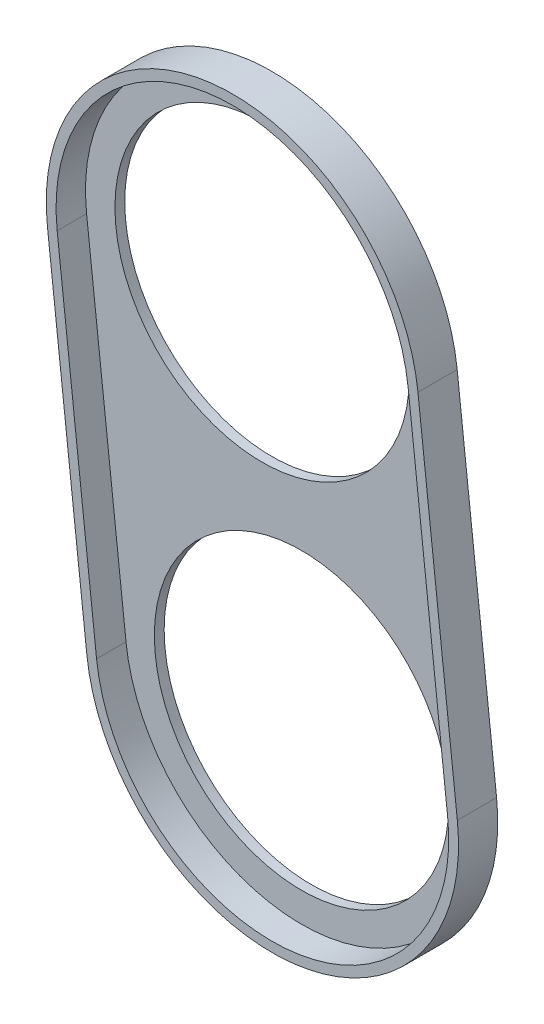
ISO-10303-21;
HEADER;
FILE_DESCRIPTION(('STEP AP214'),'2;1');
FILE_NAME('part.step','',(''),(''),'','','');
FILE_SCHEMA(('AUTOMOTIVE_DESIGN { 1 0 10303 214 1 1 1 1 }'));
ENDSEC;
DATA;
#1=APPLICATION_CONTEXT('core data for automotive mechanical design processes');
#2=APPLICATION_PROTOCOL_DEFINITION('international standard','automotive_design',2000,#1);
#3=PRODUCT_CONTEXT('',#1,'mechanical');
#4=PRODUCT('Part','Part','',(#3));
#5=PRODUCT_RELATED_PRODUCT_CATEGORY('part','',(#4));
#6=PRODUCT_DEFINITION_FORMATION('','',#4);
#7=PRODUCT_DEFINITION_CONTEXT('part definition',#1,'design');
#8=PRODUCT_DEFINITION('design','',#6,#7);
#9=PRODUCT_DEFINITION_SHAPE('','',#8);
#10=(LENGTH_UNIT() NAMED_UNIT(*) SI_UNIT(.MILLI.,.METRE.));
#11=(NAMED_UNIT(*) PLANE_ANGLE_UNIT() SI_UNIT($,.RADIAN.));
#12=(NAMED_UNIT(*) SI_UNIT($,.STERADIAN.) SOLID_ANGLE_UNIT());
#13=UNCERTAINTY_MEASURE_WITH_UNIT(LENGTH_MEASURE(1.E-05),#10,'distance_accuracy_value','');
#14=(GEOMETRIC_REPRESENTATION_CONTEXT(3) GLOBAL_UNCERTAINTY_ASSIGNED_CONTEXT((#13)) GLOBAL_UNIT_ASSIGNED_CONTEXT((#10,
#11,#12)) REPRESENTATION_CONTEXT('',''));
#15=CARTESIAN_POINT('',(0.,0.,0.));
#16=DIRECTION('',(0.,0.,1.));
#17=DIRECTION('',(1.,0.,0.));
#18=AXIS2_PLACEMENT_3D('',#15,#16,#17);
#19=CARTESIAN_POINT('',(10.0417507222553,-89.4380413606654,10.));
#20=DIRECTION('',(0.,0.,-1.));
#21=DIRECTION('',(-1.,0.,0.));
#22=AXIS2_PLACEMENT_3D('',#19,#20,#21);
#23=CYLINDRICAL_SURFACE('',#22,47.5);
#24=CARTESIAN_POINT('',(10.0417507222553,-89.4380413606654,0.));
#25=DIRECTION('',(0.,0.,1.));
#26=DIRECTION('',(1.,0.,0.));
#27=AXIS2_PLACEMENT_3D('',#24,#25,#26);
#28=CIRCLE('',#27,47.5);
#29=CARTESIAN_POINT('',(-37.1616599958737,-94.7378542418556,0.));
#30=VERTEX_POINT('',#29);
#31=CARTESIAN_POINT('',(57.2451614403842,-84.1382284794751,0.));
#32=VERTEX_POINT('',#31);
#33=EDGE_CURVE('E143',#30,#32,#28,.T.);
#34=ORIENTED_EDGE('',*,*,#33,.T.);
#35=DIRECTION('',(0.,0.,-1.));
#36=VECTOR('',#35,1.);
#37=CARTESIAN_POINT('',(57.2451614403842,-84.1382284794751,10.));
#38=LINE('',#37,#36);
#39=CARTESIAN_POINT('',(57.2451614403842,-84.1382284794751,10.));
#40=VERTEX_POINT('',#39);
#41=EDGE_CURVE('E12',#40,#32,#38,.T.);
#42=ORIENTED_EDGE('',*,*,#41,.F.);
#43=CARTESIAN_POINT('',(10.0417507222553,-89.4380413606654,10.));
#44=DIRECTION('',(0.,0.,1.));
#45=DIRECTION('',(1.,0.,0.));
#46=AXIS2_PLACEMENT_3D('',#43,#44,#45);
#47=CIRCLE('',#46,47.5);
#48=CARTESIAN_POINT('',(-37.1616599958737,-94.7378542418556,10.));
#49=VERTEX_POINT('',#48);
#50=EDGE_CURVE('E145',#49,#40,#47,.T.);
#51=ORIENTED_EDGE('',*,*,#50,.F.);
#52=DIRECTION('',(0.,0.,-1.));
#53=VECTOR('',#52,1.);
#54=CARTESIAN_POINT('',(-37.1616599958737,-94.7378542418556,10.));
#55=LINE('',#54,#53);
#56=EDGE_CURVE('E151',#49,#30,#55,.T.);
#57=ORIENTED_EDGE('',*,*,#56,.T.);
#58=EDGE_LOOP('',(#34,#42,#51,#57));
#59=FACE_BOUND('',#58,.T.);
#60=ADVANCED_FACE('F37',(#59),#23,.T.);
#61=CARTESIAN_POINT('',(47.2034107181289,5.29981288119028,10.));
#62=DIRECTION('',(-0.993756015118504,-0.111575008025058,0.));
#63=DIRECTION('',(0.111575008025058,-0.993756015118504,0.));
#64=AXIS2_PLACEMENT_3D('',#61,#62,#63);
#65=PLANE('',#64);
#66=DIRECTION('',(-0.111575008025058,0.993756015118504,0.));
#67=VECTOR('',#66,1.);
#68=CARTESIAN_POINT('',(47.2034107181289,5.29981288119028,0.));
#69=LINE('',#68,#67);
#70=CARTESIAN_POINT('',(47.2034107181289,5.29981288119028,0.));
#71=VERTEX_POINT('',#70);
#72=EDGE_CURVE('E154',#32,#71,#69,.T.);
#73=ORIENTED_EDGE('',*,*,#72,.T.);
#74=DIRECTION('',(0.,0.,-1.));
#75=VECTOR('',#74,1.);
#76=CARTESIAN_POINT('',(47.2034107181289,5.29981288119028,10.));
#77=LINE('',#76,#75);
#78=CARTESIAN_POINT('',(47.2034107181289,5.29981288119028,10.));
#79=VERTEX_POINT('',#78);
#80=EDGE_CURVE('E44',#79,#71,#77,.T.);
#81=ORIENTED_EDGE('',*,*,#80,.F.);
#82=DIRECTION('',(-0.111575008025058,0.993756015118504,0.));
#83=VECTOR('',#82,1.);
#84=CARTESIAN_POINT('',(47.2034107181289,5.29981288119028,10.));
#85=LINE('',#84,#83);
#86=EDGE_CURVE('E88',#40,#79,#85,.T.);
#87=ORIENTED_EDGE('',*,*,#86,.F.);
#88=ORIENTED_EDGE('',*,*,#41,.T.);
#89=EDGE_LOOP('',(#73,#81,#87,#88));
#90=FACE_BOUND('',#89,.T.);
#91=ADVANCED_FACE('F181',(#90),#65,.F.);
#92=CARTESIAN_POINT('',(0.,0.,10.));
#93=DIRECTION('',(0.,0.,-1.));
#94=DIRECTION('',(-1.,0.,0.));
#95=AXIS2_PLACEMENT_3D('',#92,#93,#94);
#96=CYLINDRICAL_SURFACE('',#95,47.5);
#97=CARTESIAN_POINT('',(0.,0.,0.));
#98=DIRECTION('',(0.,0.,1.));
#99=DIRECTION('',(1.,0.,0.));
#100=AXIS2_PLACEMENT_3D('',#97,#98,#99);
#101=CIRCLE('',#100,47.5);
#102=CARTESIAN_POINT('',(-47.2034107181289,-5.29981288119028,0.));
#103=VERTEX_POINT('',#102);
#104=EDGE_CURVE('E156',#71,#103,#101,.T.);
#105=ORIENTED_EDGE('',*,*,#104,.T.);
#106=DIRECTION('',(0.,0.,-1.));
#107=VECTOR('',#106,1.);
#108=CARTESIAN_POINT('',(-47.2034107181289,-5.29981288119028,10.));
#109=LINE('',#108,#107);
#110=CARTESIAN_POINT('',(-47.2034107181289,-5.29981288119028,10.));
#111=VERTEX_POINT('',#110);
#112=EDGE_CURVE('E160',#111,#103,#109,.T.);
#113=ORIENTED_EDGE('',*,*,#112,.F.);
#114=CARTESIAN_POINT('',(0.,0.,10.));
#115=DIRECTION('',(0.,0.,1.));
#116=DIRECTION('',(1.,0.,0.));
#117=AXIS2_PLACEMENT_3D('',#114,#115,#116);
#118=CIRCLE('',#117,47.5);
#119=EDGE_CURVE('E148',#79,#111,#118,.T.);
#120=ORIENTED_EDGE('',*,*,#119,.F.);
#121=ORIENTED_EDGE('',*,*,#80,.T.);
#122=EDGE_LOOP('',(#105,#113,#120,#121));
#123=FACE_BOUND('',#122,.T.);
#124=ADVANCED_FACE('F165',(#123),#96,.T.);
#125=CARTESIAN_POINT('',(-47.2034107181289,-5.29981288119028,10.));
#126=DIRECTION('',(0.993756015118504,0.111575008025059,0.));
#127=DIRECTION('',(-0.111575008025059,0.993756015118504,0.));
#128=AXIS2_PLACEMENT_3D('',#125,#126,#127);
#129=PLANE('',#128);
#130=DIRECTION('',(0.111575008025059,-0.993756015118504,0.));
#131=VECTOR('',#130,1.);
#132=CARTESIAN_POINT('',(-47.2034107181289,-5.29981288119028,0.));
#133=LINE('',#132,#131);
#134=EDGE_CURVE('E81',#103,#30,#133,.T.);
#135=ORIENTED_EDGE('',*,*,#134,.T.);
#136=ORIENTED_EDGE('',*,*,#56,.F.);
#137=DIRECTION('',(0.111575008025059,-0.993756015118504,0.));
#138=VECTOR('',#137,1.);
#139=CARTESIAN_POINT('',(-47.2034107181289,-5.29981288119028,10.));
#140=LINE('',#139,#138);
#141=EDGE_CURVE('E60',#111,#49,#140,.T.);
#142=ORIENTED_EDGE('',*,*,#141,.F.);
#143=ORIENTED_EDGE('',*,*,#112,.T.);
#144=EDGE_LOOP('',(#135,#136,#142,#143));
#145=FACE_BOUND('',#144,.T.);
#146=ADVANCED_FACE('F173',(#145),#129,.F.);
#147=CARTESIAN_POINT('',(10.0417507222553,-89.4380413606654,10.));
#148=DIRECTION('',(0.,0.,1.));
#149=DIRECTION('',(1.,0.,0.));
#150=AXIS2_PLACEMENT_3D('',#147,#148,#149);
#151=PLANE('',#150);
#152=CARTESIAN_POINT('',(10.0417507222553,-89.4380413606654,10.));
#153=DIRECTION('',(0.,0.,1.));
#154=DIRECTION('',(1.,0.,0.));
#155=AXIS2_PLACEMENT_3D('',#152,#153,#154);
#156=CIRCLE('',#155,45.);
#157=CARTESIAN_POINT('',(-34.6772699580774,-94.458916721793,10.));
#158=VERTEX_POINT('',#157);
#159=CARTESIAN_POINT('',(54.7607714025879,-84.4171659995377,10.));
#160=VERTEX_POINT('',#159);
#161=EDGE_CURVE('E51',#158,#160,#156,.T.);
#162=ORIENTED_EDGE('',*,*,#161,.F.);
#163=DIRECTION('',(0.111575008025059,-0.993756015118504,0.));
#164=VECTOR('',#163,1.);
#165=CARTESIAN_POINT('',(-44.7190206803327,-5.02087536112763,10.));
#166=LINE('',#165,#164);
#167=CARTESIAN_POINT('',(-44.7190206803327,-5.02087536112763,10.));
#168=VERTEX_POINT('',#167);
#169=EDGE_CURVE('E132',#168,#158,#166,.T.);
#170=ORIENTED_EDGE('',*,*,#169,.F.);
#171=CARTESIAN_POINT('',(0.,0.,10.));
#172=DIRECTION('',(0.,0.,1.));
#173=DIRECTION('',(1.,0.,0.));
#174=AXIS2_PLACEMENT_3D('',#171,#172,#173);
#175=CIRCLE('',#174,45.);
#176=CARTESIAN_POINT('',(44.7190206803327,5.02087536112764,10.));
#177=VERTEX_POINT('',#176);
#178=EDGE_CURVE('E116',#177,#168,#175,.T.);
#179=ORIENTED_EDGE('',*,*,#178,.F.);
#180=DIRECTION('',(-0.111575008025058,0.993756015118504,0.));
#181=VECTOR('',#180,1.);
#182=CARTESIAN_POINT('',(54.7607714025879,-84.4171659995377,10.));
#183=LINE('',#182,#181);
#184=EDGE_CURVE('E126',#160,#177,#183,.T.);
#185=ORIENTED_EDGE('',*,*,#184,.F.);
#186=EDGE_LOOP('',(#162,#170,#179,#185));
#187=FACE_BOUND('',#186,.T.);
#188=ORIENTED_EDGE('',*,*,#50,.T.);
#189=ORIENTED_EDGE('',*,*,#86,.T.);
#190=ORIENTED_EDGE('',*,*,#119,.T.);
#191=ORIENTED_EDGE('',*,*,#141,.T.);
#192=EDGE_LOOP('',(#188,#189,#190,#191));
#193=FACE_BOUND('',#192,.T.);
#194=ADVANCED_FACE('F130',(#187,#193),#151,.T.);
#195=CARTESIAN_POINT('',(10.0417507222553,-89.4380413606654,0.));
#196=DIRECTION('',(0.,0.,1.));
#197=DIRECTION('',(1.,0.,0.));
#198=AXIS2_PLACEMENT_3D('',#195,#196,#197);
#199=PLANE('',#198);
#200=CARTESIAN_POINT('',(10.0417507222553,-89.4380413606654,0.));
#201=DIRECTION('',(0.,0.,1.));
#202=DIRECTION('',(1.,0.,0.));
#203=AXIS2_PLACEMENT_3D('',#200,#201,#202);
#204=CIRCLE('',#203,37.5);
#205=CARTESIAN_POINT('',(47.5417507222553,-89.4380413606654,0.));
#206=VERTEX_POINT('',#205);
#207=EDGE_CURVE('E284',#206,#206,#204,.T.);
#208=ORIENTED_EDGE('',*,*,#207,.T.);
#209=EDGE_LOOP('',(#208));
#210=FACE_BOUND('',#209,.T.);
#211=CARTESIAN_POINT('',(0.,0.,0.));
#212=DIRECTION('',(0.,0.,1.));
#213=DIRECTION('',(1.,0.,0.));
#214=AXIS2_PLACEMENT_3D('',#211,#212,#213);
#215=CIRCLE('',#214,37.5);
#216=CARTESIAN_POINT('',(37.5,0.,0.));
#217=VERTEX_POINT('',#216);
#218=EDGE_CURVE('E292',#217,#217,#215,.T.);
#219=ORIENTED_EDGE('',*,*,#218,.T.);
#220=EDGE_LOOP('',(#219));
#221=FACE_BOUND('',#220,.T.);
#222=ORIENTED_EDGE('',*,*,#33,.F.);
#223=ORIENTED_EDGE('',*,*,#134,.F.);
#224=ORIENTED_EDGE('',*,*,#104,.F.);
#225=ORIENTED_EDGE('',*,*,#72,.F.);
#226=EDGE_LOOP('',(#222,#223,#224,#225));
#227=FACE_BOUND('',#226,.T.);
#228=ADVANCED_FACE('F169',(#210,#221,#227),#199,.F.);
#229=CARTESIAN_POINT('',(10.0417507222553,-89.4380413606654,-205.441871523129));
#230=DIRECTION('',(0.,0.,1.));
#231=DIRECTION('',(1.,0.,0.));
#232=AXIS2_PLACEMENT_3D('',#229,#230,#231);
#233=CYLINDRICAL_SURFACE('',#232,45.);
#234=CARTESIAN_POINT('',(10.0417507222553,-89.4380413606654,2.5));
#235=DIRECTION('',(0.,0.,1.));
#236=DIRECTION('',(1.,0.,0.));
#237=AXIS2_PLACEMENT_3D('',#234,#235,#236);
#238=CIRCLE('',#237,45.);
#239=CARTESIAN_POINT('',(54.7607714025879,-84.4171659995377,2.5));
#240=VERTEX_POINT('',#239);
#241=CARTESIAN_POINT('',(-34.6772699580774,-94.458916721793,2.5));
#242=VERTEX_POINT('',#241);
#243=EDGE_CURVE('E144',#240,#242,#238,.F.);
#244=ORIENTED_EDGE('',*,*,#243,.T.);
#245=DIRECTION('',(0.,0.,1.));
#246=VECTOR('',#245,1.);
#247=CARTESIAN_POINT('',(-34.6772699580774,-94.458916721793,-205.441871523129));
#248=LINE('',#247,#246);
#249=EDGE_CURVE('E137',#242,#158,#248,.T.);
#250=ORIENTED_EDGE('',*,*,#249,.T.);
#251=ORIENTED_EDGE('',*,*,#161,.T.);
#252=DIRECTION('',(0.,0.,1.));
#253=VECTOR('',#252,1.);
#254=CARTESIAN_POINT('',(54.7607714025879,-84.4171659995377,-205.441871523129));
#255=LINE('',#254,#253);
#256=EDGE_CURVE('E123',#240,#160,#255,.T.);
#257=ORIENTED_EDGE('',*,*,#256,.F.);
#258=EDGE_LOOP('',(#244,#250,#251,#257));
#259=FACE_BOUND('',#258,.T.);
#260=ADVANCED_FACE('F211',(#259),#233,.F.);
#261=CARTESIAN_POINT('',(-44.7190206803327,-5.02087536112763,-205.441871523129));
#262=DIRECTION('',(-0.993756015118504,-0.111575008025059,0.));
#263=DIRECTION('',(0.111575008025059,-0.993756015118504,0.));
#264=AXIS2_PLACEMENT_3D('',#261,#262,#263);
#265=PLANE('',#264);
#266=DIRECTION('',(-0.111575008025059,0.993756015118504,0.));
#267=VECTOR('',#266,1.);
#268=CARTESIAN_POINT('',(-44.7190206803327,-5.02087536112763,2.5));
#269=LINE('',#268,#267);
#270=CARTESIAN_POINT('',(-44.7190206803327,-5.02087536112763,2.5));
#271=VERTEX_POINT('',#270);
#272=EDGE_CURVE('E298',#242,#271,#269,.T.);
#273=ORIENTED_EDGE('',*,*,#272,.T.);
#274=DIRECTION('',(0.,0.,1.));
#275=VECTOR('',#274,1.);
#276=CARTESIAN_POINT('',(-44.7190206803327,-5.02087536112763,-205.441871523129));
#277=LINE('',#276,#275);
#278=EDGE_CURVE('E122',#271,#168,#277,.T.);
#279=ORIENTED_EDGE('',*,*,#278,.T.);
#280=ORIENTED_EDGE('',*,*,#169,.T.);
#281=ORIENTED_EDGE('',*,*,#249,.F.);
#282=EDGE_LOOP('',(#273,#279,#280,#281));
#283=FACE_BOUND('',#282,.T.);
#284=ADVANCED_FACE('F216',(#283),#265,.F.);
#285=CARTESIAN_POINT('',(0.,0.,-205.441871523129));
#286=DIRECTION('',(0.,0.,1.));
#287=DIRECTION('',(1.,0.,0.));
#288=AXIS2_PLACEMENT_3D('',#285,#286,#287);
#289=CYLINDRICAL_SURFACE('',#288,45.);
#290=CARTESIAN_POINT('',(0.,0.,2.5));
#291=DIRECTION('',(0.,0.,1.));
#292=DIRECTION('',(1.,0.,0.));
#293=AXIS2_PLACEMENT_3D('',#290,#291,#292);
#294=CIRCLE('',#293,45.);
#295=CARTESIAN_POINT('',(44.7190206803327,5.02087536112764,2.5));
#296=VERTEX_POINT('',#295);
#297=EDGE_CURVE('E119',#271,#296,#294,.F.);
#298=ORIENTED_EDGE('',*,*,#297,.T.);
#299=DIRECTION('',(0.,0.,1.));
#300=VECTOR('',#299,1.);
#301=CARTESIAN_POINT('',(44.7190206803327,5.02087536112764,-205.441871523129));
#302=LINE('',#301,#300);
#303=EDGE_CURVE('E111',#296,#177,#302,.T.);
#304=ORIENTED_EDGE('',*,*,#303,.T.);
#305=ORIENTED_EDGE('',*,*,#178,.T.);
#306=ORIENTED_EDGE('',*,*,#278,.F.);
#307=EDGE_LOOP('',(#298,#304,#305,#306));
#308=FACE_BOUND('',#307,.T.);
#309=ADVANCED_FACE('F113',(#308),#289,.F.);
#310=CARTESIAN_POINT('',(54.7607714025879,-84.4171659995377,-205.441871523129));
#311=DIRECTION('',(0.993756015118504,0.111575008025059,0.));
#312=DIRECTION('',(-0.111575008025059,0.993756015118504,0.));
#313=AXIS2_PLACEMENT_3D('',#310,#311,#312);
#314=PLANE('',#313);
#315=DIRECTION('',(0.111575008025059,-0.993756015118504,0.));
#316=VECTOR('',#315,1.);
#317=CARTESIAN_POINT('',(54.7607714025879,-84.4171659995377,2.5));
#318=LINE('',#317,#316);
#319=EDGE_CURVE('E141',#296,#240,#318,.T.);
#320=ORIENTED_EDGE('',*,*,#319,.T.);
#321=ORIENTED_EDGE('',*,*,#256,.T.);
#322=ORIENTED_EDGE('',*,*,#184,.T.);
#323=ORIENTED_EDGE('',*,*,#303,.F.);
#324=EDGE_LOOP('',(#320,#321,#322,#323));
#325=FACE_BOUND('',#324,.T.);
#326=ADVANCED_FACE('F127',(#325),#314,.F.);
#327=CARTESIAN_POINT('',(10.0417507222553,-89.4380413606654,2.5));
#328=DIRECTION('',(0.,0.,1.));
#329=DIRECTION('',(1.,0.,0.));
#330=AXIS2_PLACEMENT_3D('',#327,#328,#329);
#331=PLANE('',#330);
#332=CARTESIAN_POINT('',(10.0417507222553,-89.4380413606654,2.5));
#333=DIRECTION('',(0.,0.,1.));
#334=DIRECTION('',(1.,0.,0.));
#335=AXIS2_PLACEMENT_3D('',#332,#333,#334);
#336=CIRCLE('',#335,37.5);
#337=CARTESIAN_POINT('',(47.5417507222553,-89.4380413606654,2.5));
#338=VERTEX_POINT('',#337);
#339=EDGE_CURVE('E287',#338,#338,#336,.T.);
#340=ORIENTED_EDGE('',*,*,#339,.F.);
#341=EDGE_LOOP('',(#340));
#342=FACE_BOUND('',#341,.T.);
#343=CARTESIAN_POINT('',(0.,0.,2.5));
#344=DIRECTION('',(0.,0.,1.));
#345=DIRECTION('',(1.,0.,0.));
#346=AXIS2_PLACEMENT_3D('',#343,#344,#345);
#347=CIRCLE('',#346,37.5);
#348=CARTESIAN_POINT('',(37.5,0.,2.5));
#349=VERTEX_POINT('',#348);
#350=EDGE_CURVE('E289',#349,#349,#347,.T.);
#351=ORIENTED_EDGE('',*,*,#350,.F.);
#352=EDGE_LOOP('',(#351));
#353=FACE_BOUND('',#352,.T.);
#354=ORIENTED_EDGE('',*,*,#243,.F.);
#355=ORIENTED_EDGE('',*,*,#319,.F.);
#356=ORIENTED_EDGE('',*,*,#297,.F.);
#357=ORIENTED_EDGE('',*,*,#272,.F.);
#358=EDGE_LOOP('',(#354,#355,#356,#357));
#359=FACE_BOUND('',#358,.T.);
#360=ADVANCED_FACE('F242',(#342,#353,#359),#331,.T.);
#361=CARTESIAN_POINT('',(0.,0.,0.));
#362=DIRECTION('',(0.,0.,1.));
#363=DIRECTION('',(1.,0.,0.));
#364=AXIS2_PLACEMENT_3D('',#361,#362,#363);
#365=CYLINDRICAL_SURFACE('',#364,37.5);
#366=ORIENTED_EDGE('',*,*,#218,.F.);
#367=EDGE_LOOP('',(#366));
#368=FACE_BOUND('',#367,.T.);
#369=ORIENTED_EDGE('',*,*,#350,.T.);
#370=EDGE_LOOP('',(#369));
#371=FACE_BOUND('',#370,.T.);
#372=ADVANCED_FACE('F257',(#368,#371),#365,.F.);
#373=CARTESIAN_POINT('',(10.0417507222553,-89.4380413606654,0.));
#374=DIRECTION('',(0.,0.,1.));
#375=DIRECTION('',(1.,0.,0.));
#376=AXIS2_PLACEMENT_3D('',#373,#374,#375);
#377=CYLINDRICAL_SURFACE('',#376,37.5);
#378=ORIENTED_EDGE('',*,*,#207,.F.);
#379=EDGE_LOOP('',(#378));
#380=FACE_BOUND('',#379,.T.);
#381=ORIENTED_EDGE('',*,*,#339,.T.);
#382=EDGE_LOOP('',(#381));
#383=FACE_BOUND('',#382,.T.);
#384=ADVANCED_FACE('F267',(#380,#383),#377,.F.);
#385=CLOSED_SHELL('',(#60,#91,#124,#146,#194,#228,#260,#284,#309,#326,#360,#372,#384));
#386=MANIFOLD_SOLID_BREP('B2',#385);
#387=ADVANCED_BREP_SHAPE_REPRESENTATION('',(#18,#386),#14);
#388=SHAPE_DEFINITION_REPRESENTATION(#9,#387);
ENDSEC;
END-ISO-10303-21;
